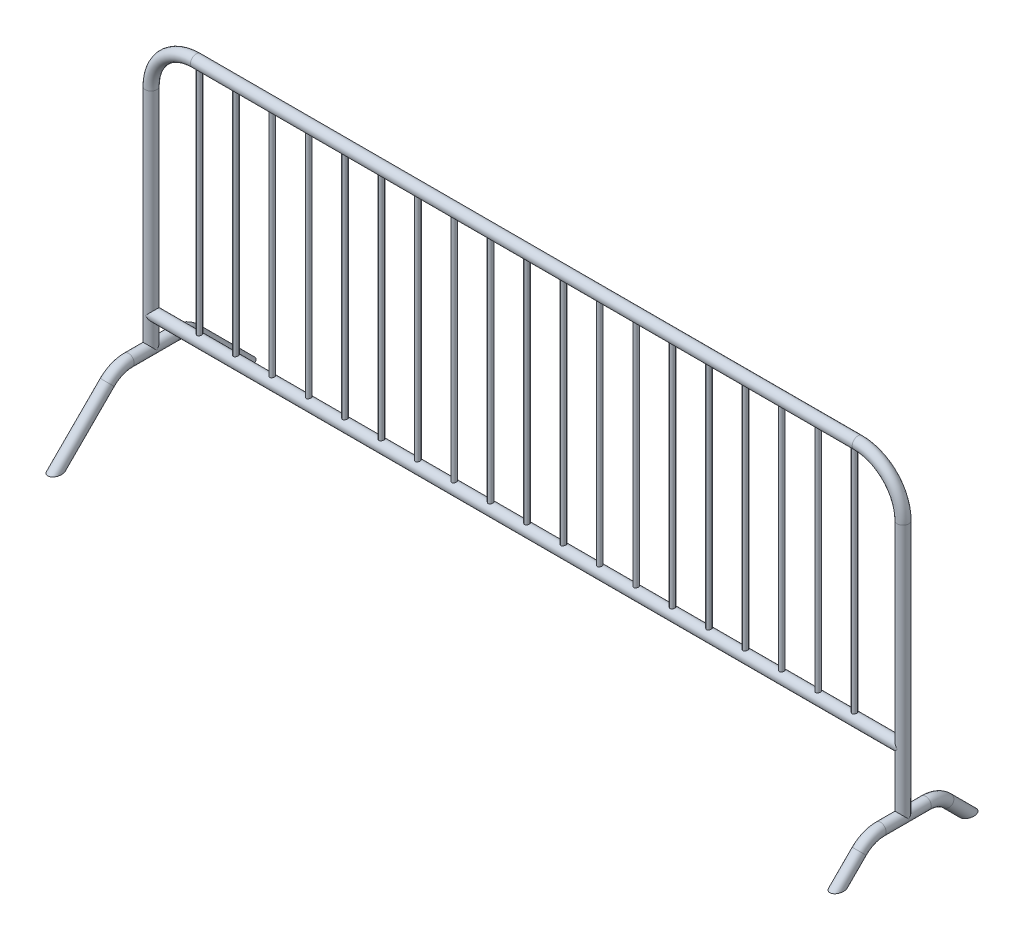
from build123d import *

# Parameters (mm, degrees)
SKETCH2_R                = 19
SKETCH2_R_2              = 17.5
SKETCH3_R                = 19
BOSS_EXTRUDE1_DEPTH      = 1250
BOSS_EXTRUDE2_REACH      = 1512.458
BOSS_EXTRUDE2_END_RADIUS = 19
SKETCH4_R                = 8
LPATTERN1_COUNT          = 19
LPATTERN1_PITCH          = 121
SKETCH6_R                = 19
SKETCH6_R_2              = 17.5
SKETCH9_R                = 19
SKETCH9_R_2              = 17.5
CUT_EXTRUDE1_DEPTH       = 1699.127756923
CUT_EXTRUDE1_DEPTH_BACK  = 1699.127756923
SKETCH7_W                = 1609.600675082
SKETCH7_H                = 353.772176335


with BuildPart() as part:
    # Sweep1: sweep along a path in Sketch1
    with BuildLine(Plane.XY) as sweep1_path:
        Line((1250, 0), (1250, 850))
        ThreePointArc((1250, 850), (1206.066017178, 956.066017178), (1100, 1000))
        Line((1100, 1000), (-1100, 1000))
        ThreePointArc((-1100, 1000), (-1206.066017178, 956.066017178), (-1250, 850))
        Line((-1250, 850), (-1250, 100))
    # Sketch2 → Sweep1 (sweep)
    with BuildSketch(Plane(origin=(0, 0, 0), x_dir=(1, 0, 0), z_dir=(0, 1, 0))):
        with Locations((1250, 0)):
            Circle(SKETCH2_R)
        with Locations((1250, 0)):
            Circle(SKETCH2_R_2, mode=Mode.SUBTRACT)
    sweep(path=sweep1_path.line)

    # Sketch3 → Boss-Extrude1 (add, symmetric)
    with BuildSketch(Plane(origin=(0, 0, 0), x_dir=(0, 0, -1), z_dir=(1, 0, 0))):
        with Locations(Location((0, 200, 0), (0, 0, 180))):
            Circle(SKETCH3_R)
    extrude(amount=BOSS_EXTRUDE1_DEPTH, both=True)

    # Boss-Extrude2: up to this cylinder (the profile starts outside it)
    boss_extrude2_end = Plane(origin=(-1089, 1000, 0), z_dir=(-1, 0, 0)) * Cylinder(BOSS_EXTRUDE2_END_RADIUS, 3063.916, mode=Mode.PRIVATE)
    # Sketch4 → Boss-Extrude2 (add, up to the surface)
    with BuildSketch(Plane(origin=(0, 200, 0), x_dir=(1, 0, 0), z_dir=(0, 1, 0)), mode=Mode.PRIVATE) as boss_extrude2_sk1:
        with Locations(Location((-1089, 0, 0), (0, 0, 90))):
            Circle(SKETCH4_R)
    boss_extrude2_tool1 = extrude(boss_extrude2_sk1.sketch, amount=BOSS_EXTRUDE2_REACH, mode=Mode.PRIVATE) - boss_extrude2_end
    boss_extrude2 = boss_extrude2_tool1.solids().sort_by_distance((-1089, 200, 0))[0]
    add(boss_extrude2)

    # LPattern1: Boss-Extrude2 ×19
    with Locations(*[(i * LPATTERN1_PITCH, 0, 0) for i in range(1, LPATTERN1_COUNT)]):
        add(boss_extrude2)

    # Sweep2: sweep along a path in Sketch5
    with BuildLine(Plane(origin=(1250, 0, 0), x_dir=(0, 0, -1), z_dir=(1, 0, 0))) as sweep2_path:
        Line((0, 0), (75, 0))
        ThreePointArc((75, 0), (113.268343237, -7.612046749), (145.710678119, -29.289321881))
        Line((145.710678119, -29.289321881), (370.751195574, -254.329839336))
    # Sketch6 → Sweep2 (sweep)
    with BuildSketch(Plane.XY):
        with Locations((1250, 0)):
            Circle(SKETCH6_R)
        with Locations((1250, 0)):
            Circle(SKETCH6_R_2, mode=Mode.SUBTRACT)
    sweep2 = sweep(path=sweep2_path.line)

    # Mirror1: Sweep2 across plane
    add(sweep2.mirror(Plane.XY))

    # Sweep3: sweep along a path in Sketch8
    with BuildLine(Plane(origin=(-1250, 0, 0), x_dir=(0, 0, -1), z_dir=(1, 0, 0))) as sweep3_path:
        Line((0, 100), (-75, 100))
        ThreePointArc((-75, 100), (-113.268343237, 92.387953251), (-145.710678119, 70.710678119))
        Line((-145.710678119, 70.710678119), (-471.246184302, -254.824828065))
    # Sketch9 → Sweep3 (sweep)
    with BuildSketch(Plane.XY):
        with Locations((-1250, 100)):
            Circle(SKETCH9_R)
        with Locations((-1250, 100)):
            Circle(SKETCH9_R_2, mode=Mode.SUBTRACT)
    sweep3 = sweep(path=sweep3_path.line)

    # Mirror2: Sweep3 across plane
    add(sweep3.mirror(Plane(origin=(-1250, 100, 0), x_dir=(1, 0, 0), z_dir=(0, 0, 1))))

    # Sketch7 → Cut-Extrude1 (cut, two sides: drawn at the far end of the back side and taken through both)
    with BuildSketch(Plane(origin=(0, 0, 0), x_dir=(0, 0, -1), z_dir=(1, 0, 0)).offset(-CUT_EXTRUDE1_DEPTH_BACK)):
        with Locations((-60.565331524, -276.886088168)):
            Rectangle(SKETCH7_W, SKETCH7_H)
    extrude(amount=CUT_EXTRUDE1_DEPTH + CUT_EXTRUDE1_DEPTH_BACK, mode=Mode.SUBTRACT)


solid = part.part
